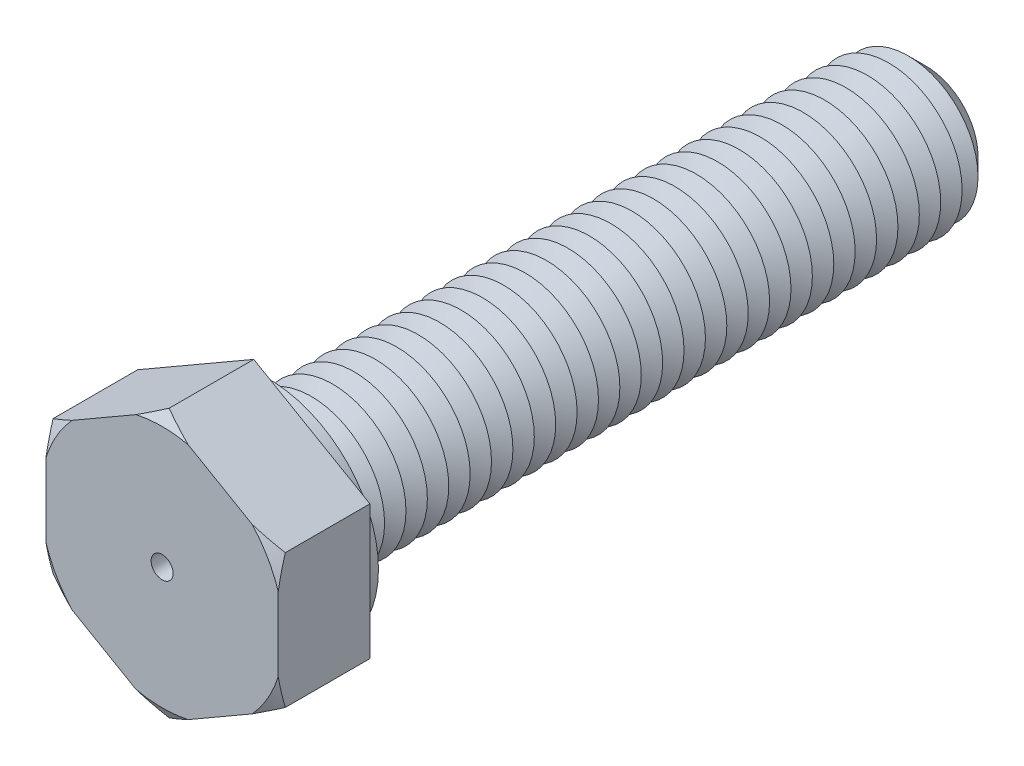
from build123d import *

# Parameters (mm, degrees)
BOSS_EXTRUDE1_DEPTH = 7.5
SKETCH3_R           = 6
BOSS_EXTRUDE2_DEPTH = 55
SKETCH4_R           = 9
BOSS_EXTRUDE3_DEPTH = 1.2
CHAMFER1_SIZE       = 1.75
LPATTERN1_COUNT     = 30
LPATTERN1_PITCH     = 1.75
SKETCH8_R           = 0.9
CUT_EXTRUDE1_DEPTH  = 62.5


with BuildPart() as part:
    # Sketch2 → Boss-Extrude1 (new body)
    with BuildSketch(Plane.XY):
        Polygon((0, 10.969655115), (-9.5, 5.484827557), (-9.5, -5.484827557), (0, -10.969655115), (9.5, -5.484827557), (9.5, 5.484827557), align=None)
    extrude(amount=BOSS_EXTRUDE1_DEPTH)

    # Sketch3 → Boss-Extrude2 (add)
    with BuildSketch(Plane(origin=(0, 0, 0), x_dir=(-1, 0, 0), z_dir=(0, 0, -1))):
        Circle(SKETCH3_R)
    extrude(amount=BOSS_EXTRUDE2_DEPTH)

    # Sketch4 → Boss-Extrude3 (add)
    with BuildSketch(Plane(origin=(0, 0, 0), x_dir=(-1, 0, 0), z_dir=(0, 0, -1))):
        with Locations(Location((0, 0, 0), (0, 0, 180))):
            Circle(SKETCH4_R)
    extrude(amount=BOSS_EXTRUDE3_DEPTH)

    # Chamfer1
    chamfer1_edges = [part.edges().sort_by_distance(p)[0] for p in [
        (6, 0, -55),
    ]]
    chamfer(chamfer1_edges, length=CHAMFER1_SIZE)

    # Sketch6 → Cut-Revolve1 (revolve, cut)
    with BuildSketch(Plane(origin=(0, 0, 0), x_dir=(0, 0, -1), z_dir=(1, 0, 0)), mode=Mode.PRIVATE) as cut_revolve1_sk:
        Polygon((1.2, 6), (2.075, 4.484455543), (2.95, 6), align=None)
    cut_revolve1 = revolve(cut_revolve1_sk.sketch.rotate(Axis((0, 0, 3.211670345), (0, 0, -1)), 90), axis=Axis((0, 0, 3.211670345), (0, 0, -1)), mode=Mode.SUBTRACT)

    # LPattern1: Cut-Revolve1 ×30
    with Locations(*[(0, 0, -i * LPATTERN1_PITCH) for i in range(1, LPATTERN1_COUNT)]):
        add(cut_revolve1, mode=Mode.SUBTRACT)

    # Sketch7 → Cut-Revolve2 (revolve, cut)
    with BuildSketch(Plane(origin=(0, 0, 0), x_dir=(0, 0, -1), z_dir=(1, 0, 0)), mode=Mode.PRIVATE) as cut_revolve2_sk:
        Polygon((-7.5, 10.969655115), (-7.5, 9.969655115), (-6.922649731, 10.969655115), align=None)
    revolve(cut_revolve2_sk.sketch.rotate(Axis((0, 0, 3.211670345), (0, 0, -1)), 90), axis=Axis((0, 0, 3.211670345), (0, 0, -1)), mode=Mode.SUBTRACT)

    # Sketch8 → Cut-Extrude1 (cut)
    with BuildSketch(Plane.XY.offset(7.5)):
        Circle(SKETCH8_R)
    extrude(amount=-CUT_EXTRUDE1_DEPTH, mode=Mode.SUBTRACT)


solid = part.part
